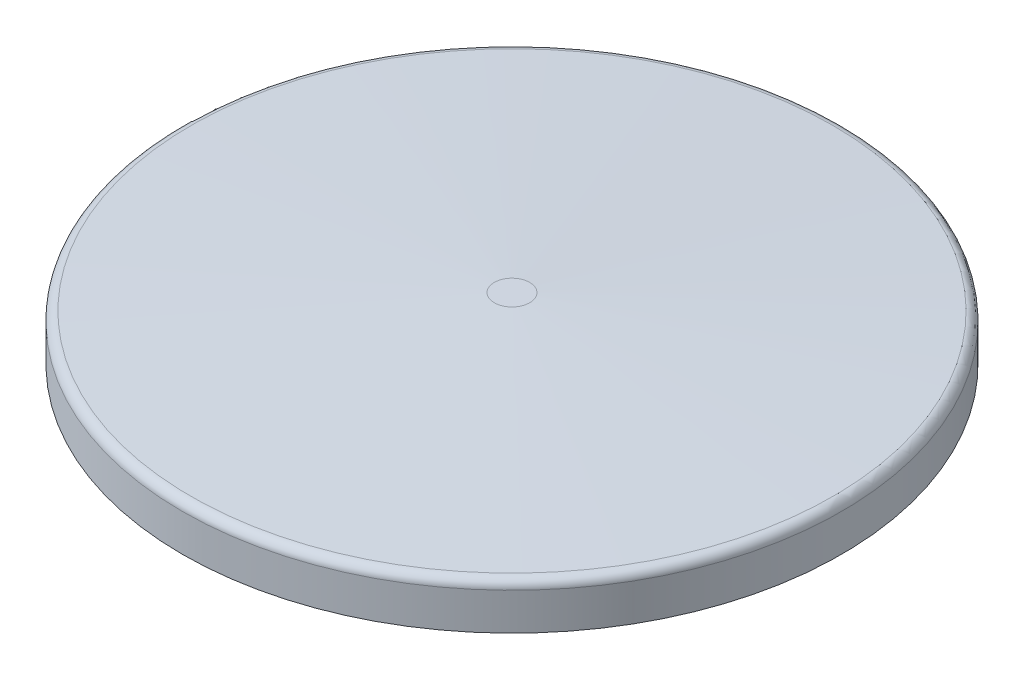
ISO-10303-21;
HEADER;
FILE_DESCRIPTION(('STEP AP214'),'2;1');
FILE_NAME('part.step','',(''),(''),'','','');
FILE_SCHEMA(('AUTOMOTIVE_DESIGN { 1 0 10303 214 1 1 1 1 }'));
ENDSEC;
DATA;
#1=APPLICATION_CONTEXT('core data for automotive mechanical design processes');
#2=APPLICATION_PROTOCOL_DEFINITION('international standard','automotive_design',2000,#1);
#3=PRODUCT_CONTEXT('',#1,'mechanical');
#4=PRODUCT('Part','Part','',(#3));
#5=PRODUCT_RELATED_PRODUCT_CATEGORY('part','',(#4));
#6=PRODUCT_DEFINITION_FORMATION('','',#4);
#7=PRODUCT_DEFINITION_CONTEXT('part definition',#1,'design');
#8=PRODUCT_DEFINITION('design','',#6,#7);
#9=PRODUCT_DEFINITION_SHAPE('','',#8);
#10=(LENGTH_UNIT() NAMED_UNIT(*) SI_UNIT(.MILLI.,.METRE.));
#11=(NAMED_UNIT(*) PLANE_ANGLE_UNIT() SI_UNIT($,.RADIAN.));
#12=(NAMED_UNIT(*) SI_UNIT($,.STERADIAN.) SOLID_ANGLE_UNIT());
#13=UNCERTAINTY_MEASURE_WITH_UNIT(LENGTH_MEASURE(1.E-05),#10,'distance_accuracy_value','');
#14=(GEOMETRIC_REPRESENTATION_CONTEXT(3) GLOBAL_UNCERTAINTY_ASSIGNED_CONTEXT((#13)) GLOBAL_UNIT_ASSIGNED_CONTEXT((#10,
#11,#12)) REPRESENTATION_CONTEXT('',''));
#15=CARTESIAN_POINT('',(0.,0.,0.));
#16=DIRECTION('',(0.,0.,1.));
#17=DIRECTION('',(1.,0.,0.));
#18=AXIS2_PLACEMENT_3D('',#15,#16,#17);
#19=CARTESIAN_POINT('',(-117.475,0.,0.));
#20=DIRECTION('',(0.,1.,0.));
#21=DIRECTION('',(0.,0.,1.));
#22=AXIS2_PLACEMENT_3D('',#19,#20,#21);
#23=PLANE('',#22);
#24=CARTESIAN_POINT('',(39.0337101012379,0.,-94.2357123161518));
#25=DIRECTION('',(0.,-1.,0.));
#26=DIRECTION('',(0.,0.,-1.));
#27=AXIS2_PLACEMENT_3D('',#24,#25,#26);
#28=CIRCLE('',#27,2.579751);
#29=CARTESIAN_POINT('',(39.0337101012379,0.,-96.8154633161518));
#30=VERTEX_POINT('',#29);
#31=EDGE_CURVE('E176',#30,#30,#28,.T.);
#32=ORIENTED_EDGE('',*,*,#31,.F.);
#33=EDGE_LOOP('',(#32));
#34=FACE_BOUND('',#33,.T.);
#35=CARTESIAN_POINT('',(72.124891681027,0.,-72.1248916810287));
#36=DIRECTION('',(0.,-1.,0.));
#37=DIRECTION('',(0.,0.,-1.));
#38=AXIS2_PLACEMENT_3D('',#35,#36,#37);
#39=CIRCLE('',#38,2.57975100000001);
#40=CARTESIAN_POINT('',(72.124891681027,0.,-74.7046426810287));
#41=VERTEX_POINT('',#40);
#42=EDGE_CURVE('E170',#41,#41,#39,.T.);
#43=ORIENTED_EDGE('',*,*,#42,.F.);
#44=EDGE_LOOP('',(#43));
#45=FACE_BOUND('',#44,.T.);
#46=CARTESIAN_POINT('',(94.2357123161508,0.,-39.0337101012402));
#47=DIRECTION('',(0.,-1.,0.));
#48=DIRECTION('',(0.,0.,-1.));
#49=AXIS2_PLACEMENT_3D('',#46,#47,#48);
#50=CIRCLE('',#49,2.57975099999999);
#51=CARTESIAN_POINT('',(94.2357123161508,0.,-41.6134611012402));
#52=VERTEX_POINT('',#51);
#53=EDGE_CURVE('E164',#52,#52,#50,.T.);
#54=ORIENTED_EDGE('',*,*,#53,.F.);
#55=EDGE_LOOP('',(#54));
#56=FACE_BOUND('',#55,.T.);
#57=CARTESIAN_POINT('',(102.,0.,-1.068393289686E-12));
#58=DIRECTION('',(0.,-1.,0.));
#59=DIRECTION('',(0.,0.,-1.));
#60=AXIS2_PLACEMENT_3D('',#57,#58,#59);
#61=CIRCLE('',#60,2.57975100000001);
#62=CARTESIAN_POINT('',(102.,0.,-2.57975100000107));
#63=VERTEX_POINT('',#62);
#64=EDGE_CURVE('E158',#63,#63,#61,.T.);
#65=ORIENTED_EDGE('',*,*,#64,.F.);
#66=EDGE_LOOP('',(#65));
#67=FACE_BOUND('',#66,.T.);
#68=CARTESIAN_POINT('',(94.2357123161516,0.,39.0337101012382));
#69=DIRECTION('',(0.,-1.,0.));
#70=DIRECTION('',(0.,0.,-1.));
#71=AXIS2_PLACEMENT_3D('',#68,#69,#70);
#72=CIRCLE('',#71,2.57975099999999);
#73=CARTESIAN_POINT('',(94.2357123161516,0.,36.4539591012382));
#74=VERTEX_POINT('',#73);
#75=EDGE_CURVE('E152',#74,#74,#72,.T.);
#76=ORIENTED_EDGE('',*,*,#75,.F.);
#77=EDGE_LOOP('',(#76));
#78=FACE_BOUND('',#77,.T.);
#79=CARTESIAN_POINT('',(72.1248916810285,0.,72.1248916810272));
#80=DIRECTION('',(0.,-1.,0.));
#81=DIRECTION('',(0.,0.,-1.));
#82=AXIS2_PLACEMENT_3D('',#79,#80,#81);
#83=CIRCLE('',#82,2.57975100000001);
#84=CARTESIAN_POINT('',(72.1248916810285,0.,69.5451406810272));
#85=VERTEX_POINT('',#84);
#86=EDGE_CURVE('E146',#85,#85,#83,.T.);
#87=ORIENTED_EDGE('',*,*,#86,.F.);
#88=EDGE_LOOP('',(#87));
#89=FACE_BOUND('',#88,.T.);
#90=CARTESIAN_POINT('',(39.0337101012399,0.,94.2357123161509));
#91=DIRECTION('',(0.,-1.,0.));
#92=DIRECTION('',(0.,0.,-1.));
#93=AXIS2_PLACEMENT_3D('',#90,#91,#92);
#94=CIRCLE('',#93,2.579751);
#95=CARTESIAN_POINT('',(39.0337101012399,0.,91.655961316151));
#96=VERTEX_POINT('',#95);
#97=EDGE_CURVE('E140',#96,#96,#94,.T.);
#98=ORIENTED_EDGE('',*,*,#97,.F.);
#99=EDGE_LOOP('',(#98));
#100=FACE_BOUND('',#99,.T.);
#101=CARTESIAN_POINT('',(0.,0.,102.));
#102=DIRECTION('',(0.,-1.,0.));
#103=DIRECTION('',(0.,0.,-1.));
#104=AXIS2_PLACEMENT_3D('',#101,#102,#103);
#105=CIRCLE('',#104,2.579751);
#106=CARTESIAN_POINT('',(0.,0.,99.420249));
#107=VERTEX_POINT('',#106);
#108=EDGE_CURVE('E134',#107,#107,#105,.T.);
#109=ORIENTED_EDGE('',*,*,#108,.F.);
#110=EDGE_LOOP('',(#109));
#111=FACE_BOUND('',#110,.T.);
#112=CARTESIAN_POINT('',(-72.1248916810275,0.,72.1248916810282));
#113=DIRECTION('',(0.,-1.,0.));
#114=DIRECTION('',(0.,0.,-1.));
#115=AXIS2_PLACEMENT_3D('',#112,#113,#114);
#116=CIRCLE('',#115,2.57975100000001);
#117=CARTESIAN_POINT('',(-72.1248916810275,0.,69.5451406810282));
#118=VERTEX_POINT('',#117);
#119=EDGE_CURVE('E122',#118,#118,#116,.T.);
#120=ORIENTED_EDGE('',*,*,#119,.F.);
#121=EDGE_LOOP('',(#120));
#122=FACE_BOUND('',#121,.T.);
#123=CARTESIAN_POINT('',(-94.2357123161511,0.,39.0337101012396));
#124=DIRECTION('',(0.,-1.,0.));
#125=DIRECTION('',(0.,0.,-1.));
#126=AXIS2_PLACEMENT_3D('',#123,#124,#125);
#127=CIRCLE('',#126,2.57975100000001);
#128=CARTESIAN_POINT('',(-94.2357123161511,0.,36.4539591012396));
#129=VERTEX_POINT('',#128);
#130=EDGE_CURVE('E116',#129,#129,#127,.T.);
#131=ORIENTED_EDGE('',*,*,#130,.F.);
#132=EDGE_LOOP('',(#131));
#133=FACE_BOUND('',#132,.T.);
#134=CARTESIAN_POINT('',(-102.,0.,3.56131096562E-13));
#135=DIRECTION('',(0.,-1.,0.));
#136=DIRECTION('',(0.,0.,-1.));
#137=AXIS2_PLACEMENT_3D('',#134,#135,#136);
#138=CIRCLE('',#137,2.57975100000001);
#139=CARTESIAN_POINT('',(-102.,0.,-2.57975099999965));
#140=VERTEX_POINT('',#139);
#141=EDGE_CURVE('E110',#140,#140,#138,.T.);
#142=ORIENTED_EDGE('',*,*,#141,.F.);
#143=EDGE_LOOP('',(#142));
#144=FACE_BOUND('',#143,.T.);
#145=CARTESIAN_POINT('',(-94.2357123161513,0.,-39.0337101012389));
#146=DIRECTION('',(0.,-1.,0.));
#147=DIRECTION('',(0.,0.,-1.));
#148=AXIS2_PLACEMENT_3D('',#145,#146,#147);
#149=CIRCLE('',#148,2.57975100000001);
#150=CARTESIAN_POINT('',(-94.2357123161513,0.,-41.6134611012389));
#151=VERTEX_POINT('',#150);
#152=EDGE_CURVE('E104',#151,#151,#149,.T.);
#153=ORIENTED_EDGE('',*,*,#152,.F.);
#154=EDGE_LOOP('',(#153));
#155=FACE_BOUND('',#154,.T.);
#156=CARTESIAN_POINT('',(-72.124891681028,0.,-72.1248916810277));
#157=DIRECTION('',(0.,-1.,0.));
#158=DIRECTION('',(0.,0.,-1.));
#159=AXIS2_PLACEMENT_3D('',#156,#157,#158);
#160=CIRCLE('',#159,2.57975100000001);
#161=CARTESIAN_POINT('',(-72.124891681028,0.,-74.7046426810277));
#162=VERTEX_POINT('',#161);
#163=EDGE_CURVE('E98',#162,#162,#160,.T.);
#164=ORIENTED_EDGE('',*,*,#163,.F.);
#165=EDGE_LOOP('',(#164));
#166=FACE_BOUND('',#165,.T.);
#167=CARTESIAN_POINT('',(-39.0337101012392,0.,-94.2357123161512));
#168=DIRECTION('',(0.,-1.,0.));
#169=DIRECTION('',(0.,0.,-1.));
#170=AXIS2_PLACEMENT_3D('',#167,#168,#169);
#171=CIRCLE('',#170,2.579751);
#172=CARTESIAN_POINT('',(-39.0337101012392,0.,-96.8154633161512));
#173=VERTEX_POINT('',#172);
#174=EDGE_CURVE('E92',#173,#173,#171,.T.);
#175=ORIENTED_EDGE('',*,*,#174,.F.);
#176=EDGE_LOOP('',(#175));
#177=FACE_BOUND('',#176,.T.);
#178=CARTESIAN_POINT('',(0.,0.,-102.));
#179=DIRECTION('',(0.,-1.,0.));
#180=DIRECTION('',(0.,0.,-1.));
#181=AXIS2_PLACEMENT_3D('',#178,#179,#180);
#182=CIRCLE('',#181,2.579751);
#183=CARTESIAN_POINT('',(0.,0.,-104.579751));
#184=VERTEX_POINT('',#183);
#185=EDGE_CURVE('E86',#184,#184,#182,.T.);
#186=ORIENTED_EDGE('',*,*,#185,.F.);
#187=EDGE_LOOP('',(#186));
#188=FACE_BOUND('',#187,.T.);
#189=CARTESIAN_POINT('',(0.,0.,0.));
#190=DIRECTION('',(0.,-1.,0.));
#191=DIRECTION('',(0.,0.,-1.));
#192=AXIS2_PLACEMENT_3D('',#189,#190,#191);
#193=CIRCLE('',#192,95.);
#194=CARTESIAN_POINT('',(0.,0.,-95.));
#195=VERTEX_POINT('',#194);
#196=EDGE_CURVE('E53',#195,#195,#193,.T.);
#197=ORIENTED_EDGE('',*,*,#196,.F.);
#198=EDGE_LOOP('',(#197));
#199=FACE_BOUND('',#198,.T.);
#200=CARTESIAN_POINT('',(0.,0.,0.));
#201=DIRECTION('',(0.,-1.,0.));
#202=DIRECTION('',(0.,0.,-1.));
#203=AXIS2_PLACEMENT_3D('',#200,#201,#202);
#204=CIRCLE('',#203,107.6198);
#205=CARTESIAN_POINT('',(0.,0.,-107.6198));
#206=VERTEX_POINT('',#205);
#207=EDGE_CURVE('E62',#206,#206,#204,.T.);
#208=ORIENTED_EDGE('',*,*,#207,.T.);
#209=EDGE_LOOP('',(#208));
#210=FACE_BOUND('',#209,.T.);
#211=CARTESIAN_POINT('',(-39.0337101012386,0.,94.2357123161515));
#212=DIRECTION('',(0.,-1.,0.));
#213=DIRECTION('',(0.,0.,-1.));
#214=AXIS2_PLACEMENT_3D('',#211,#212,#213);
#215=CIRCLE('',#214,2.579751);
#216=CARTESIAN_POINT('',(-39.0337101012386,0.,91.6559613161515));
#217=VERTEX_POINT('',#216);
#218=EDGE_CURVE('E128',#217,#217,#215,.T.);
#219=ORIENTED_EDGE('',*,*,#218,.F.);
#220=EDGE_LOOP('',(#219));
#221=FACE_BOUND('',#220,.T.);
#222=ADVANCED_FACE('F30',(#34,#45,#56,#67,#78,#89,#100,#111,#122,#133,#144,#155,#166,#177,#188,
#199,#210,#221),#23,.F.);
#223=CARTESIAN_POINT('',(0.,0.,0.));
#224=DIRECTION('',(0.,-1.,0.));
#225=DIRECTION('',(0.,0.,-1.));
#226=AXIS2_PLACEMENT_3D('',#223,#224,#225);
#227=CYLINDRICAL_SURFACE('',#226,117.475);
#228=CARTESIAN_POINT('',(0.,0.,0.));
#229=DIRECTION('',(0.,-1.,0.));
#230=DIRECTION('',(0.,0.,-1.));
#231=AXIS2_PLACEMENT_3D('',#228,#229,#230);
#232=CIRCLE('',#231,117.475);
#233=CARTESIAN_POINT('',(0.,0.,-117.475));
#234=VERTEX_POINT('',#233);
#235=EDGE_CURVE('E56',#234,#234,#232,.T.);
#236=ORIENTED_EDGE('',*,*,#235,.F.);
#237=EDGE_LOOP('',(#236));
#238=FACE_BOUND('',#237,.T.);
#239=CARTESIAN_POINT('',(0.,13.2430375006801,0.));
#240=DIRECTION('',(0.,-1.,0.));
#241=DIRECTION('',(0.,0.,-1.));
#242=AXIS2_PLACEMENT_3D('',#239,#240,#241);
#243=CIRCLE('',#242,117.475);
#244=CARTESIAN_POINT('',(0.,13.2430375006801,-117.475));
#245=VERTEX_POINT('',#244);
#246=EDGE_CURVE('E10',#245,#245,#243,.T.);
#247=ORIENTED_EDGE('',*,*,#246,.T.);
#248=EDGE_LOOP('',(#247));
#249=FACE_BOUND('',#248,.T.);
#250=ADVANCED_FACE('F32',(#238,#249),#227,.T.);
#251=CARTESIAN_POINT('',(0.,13.2430375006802,0.));
#252=DIRECTION('',(0.,-1.,0.));
#253=DIRECTION('',(0.,0.,-1.));
#254=AXIS2_PLACEMENT_3D('',#251,#252,#253);
#255=TOROIDAL_SURFACE('',#254,114.3,3.175);
#256=ORIENTED_EDGE('',*,*,#246,.F.);
#257=EDGE_LOOP('',(#256));
#258=FACE_BOUND('',#257,.T.);
#259=CARTESIAN_POINT('',(0.,16.4136862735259,0.));
#260=DIRECTION('',(0.,-1.,0.));
#261=DIRECTION('',(0.,0.,-1.));
#262=AXIS2_PLACEMENT_3D('',#259,#260,#261);
#263=CIRCLE('',#262,114.466166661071);
#264=CARTESIAN_POINT('',(0.,16.4136862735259,-114.466166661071));
#265=VERTEX_POINT('',#264);
#266=EDGE_CURVE('E37',#265,#265,#263,.T.);
#267=ORIENTED_EDGE('',*,*,#266,.T.);
#268=EDGE_LOOP('',(#267));
#269=FACE_BOUND('',#268,.T.);
#270=ADVANCED_FACE('F342',(#258,#269),#255,.T.);
#271=CARTESIAN_POINT('',(0.,22.0826574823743,0.));
#272=DIRECTION('',(0.,-1.,0.));
#273=DIRECTION('',(0.,0.,-1.));
#274=AXIS2_PLACEMENT_3D('',#271,#272,#273);
#275=CONICAL_SURFACE('',#274,6.29575214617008,1.5184364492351);
#276=CARTESIAN_POINT('',(0.,22.0826574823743,0.));
#277=DIRECTION('',(0.,-1.,0.));
#278=DIRECTION('',(0.,0.,-1.));
#279=AXIS2_PLACEMENT_3D('',#276,#277,#278);
#280=CIRCLE('',#279,6.29575214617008);
#281=CARTESIAN_POINT('',(0.,22.0826574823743,-6.29575214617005));
#282=VERTEX_POINT('',#281);
#283=EDGE_CURVE('E41',#282,#282,#280,.T.);
#284=CARTESIAN_POINT('',(0.,16.4136862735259,-114.466166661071));
#285=CARTESIAN_POINT('',(0.,16.4727380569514,-113.339391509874));
#286=CARTESIAN_POINT('',(0.,16.5317898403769,-112.212616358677));
#287=CARTESIAN_POINT('',(0.,16.649893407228,-109.959066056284));
#288=CARTESIAN_POINT('',(0.,16.7089451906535,-108.832290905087));
#289=CARTESIAN_POINT('',(0.,16.8270487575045,-106.578740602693));
#290=CARTESIAN_POINT('',(0.,16.88610054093,-105.451965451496));
#291=CARTESIAN_POINT('',(0.,17.004204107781,-103.198415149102));
#292=CARTESIAN_POINT('',(0.,17.0632558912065,-102.071639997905));
#293=CARTESIAN_POINT('',(0.,17.1813594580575,-99.8180896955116));
#294=CARTESIAN_POINT('',(0.,17.240411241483,-98.6913145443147));
#295=CARTESIAN_POINT('',(0.,17.358514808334,-96.4377642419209));
#296=CARTESIAN_POINT('',(0.,17.4175665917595,-95.310989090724));
#297=CARTESIAN_POINT('',(0.,17.5356701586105,-93.0574387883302));
#298=CARTESIAN_POINT('',(0.,17.594721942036,-91.9306636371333));
#299=CARTESIAN_POINT('',(0.,17.712825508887,-89.6771133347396));
#300=CARTESIAN_POINT('',(0.,17.7718772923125,-88.5503381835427));
#301=CARTESIAN_POINT('',(0.,17.8899808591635,-86.2967878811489));
#302=CARTESIAN_POINT('',(0.,17.949032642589,-85.170012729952));
#303=CARTESIAN_POINT('',(0.,18.06713620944,-82.9164624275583));
#304=CARTESIAN_POINT('',(0.,18.1261879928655,-81.7896872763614));
#305=CARTESIAN_POINT('',(0.,18.2442915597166,-79.5361369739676));
#306=CARTESIAN_POINT('',(0.,18.3033433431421,-78.4093618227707));
#307=CARTESIAN_POINT('',(0.,18.4214469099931,-76.155811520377));
#308=CARTESIAN_POINT('',(0.,18.4804986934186,-75.0290363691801));
#309=CARTESIAN_POINT('',(0.,18.5986022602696,-72.7754860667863));
#310=CARTESIAN_POINT('',(0.,18.6576540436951,-71.6487109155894));
#311=CARTESIAN_POINT('',(0.,18.7757576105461,-69.3951606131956));
#312=CARTESIAN_POINT('',(0.,18.8348093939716,-68.2683854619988));
#313=CARTESIAN_POINT('',(0.,18.9529129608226,-66.014835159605));
#314=CARTESIAN_POINT('',(0.,19.0119647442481,-64.8880600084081));
#315=CARTESIAN_POINT('',(0.,19.1300683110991,-62.6345097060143));
#316=CARTESIAN_POINT('',(0.,19.1891200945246,-61.5077345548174));
#317=CARTESIAN_POINT('',(0.,19.3072236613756,-59.2541842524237));
#318=CARTESIAN_POINT('',(0.,19.3662754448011,-58.1274091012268));
#319=CARTESIAN_POINT('',(0.,19.4843790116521,-55.873858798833));
#320=CARTESIAN_POINT('',(0.,19.5434307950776,-54.7470836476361));
#321=CARTESIAN_POINT('',(0.,19.6615343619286,-52.4935333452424));
#322=CARTESIAN_POINT('',(0.,19.7205861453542,-51.3667581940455));
#323=CARTESIAN_POINT('',(0.,19.8386897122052,-49.1132078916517));
#324=CARTESIAN_POINT('',(0.,19.8977414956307,-47.9864327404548));
#325=CARTESIAN_POINT('',(0.,20.0158450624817,-45.732882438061));
#326=CARTESIAN_POINT('',(0.,20.0748968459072,-44.6061072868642));
#327=CARTESIAN_POINT('',(0.,20.1930004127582,-42.3525569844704));
#328=CARTESIAN_POINT('',(0.,20.2520521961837,-41.2257818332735));
#329=CARTESIAN_POINT('',(0.,20.3701557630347,-38.9722315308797));
#330=CARTESIAN_POINT('',(0.,20.4292075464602,-37.8454563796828));
#331=CARTESIAN_POINT('',(0.,20.5473111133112,-35.5919060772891));
#332=CARTESIAN_POINT('',(0.,20.6063628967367,-34.4651309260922));
#333=CARTESIAN_POINT('',(0.,20.7244664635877,-32.2115806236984));
#334=CARTESIAN_POINT('',(0.,20.7835182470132,-31.0848054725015));
#335=CARTESIAN_POINT('',(0.,20.9016218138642,-28.8312551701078));
#336=CARTESIAN_POINT('',(0.,20.9606735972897,-27.7044800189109));
#337=CARTESIAN_POINT('',(0.,21.0787771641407,-25.4509297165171));
#338=CARTESIAN_POINT('',(0.,21.1378289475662,-24.3241545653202));
#339=CARTESIAN_POINT('',(0.,21.2559325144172,-22.0706042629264));
#340=CARTESIAN_POINT('',(0.,21.3149842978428,-20.9438291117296));
#341=CARTESIAN_POINT('',(0.,21.4330878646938,-18.6902788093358));
#342=CARTESIAN_POINT('',(0.,21.4921396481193,-17.5635036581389));
#343=CARTESIAN_POINT('',(0.,21.6102432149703,-15.3099533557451));
#344=CARTESIAN_POINT('',(0.,21.6692949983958,-14.1831782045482));
#345=CARTESIAN_POINT('',(0.,21.7873985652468,-11.9296279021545));
#346=CARTESIAN_POINT('',(0.,21.8464503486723,-10.8028527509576));
#347=CARTESIAN_POINT('',(0.,21.9645539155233,-8.54930244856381));
#348=CARTESIAN_POINT('',(0.,22.0236056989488,-7.42252729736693));
#349=CARTESIAN_POINT('',(0.,22.0826574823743,-6.29575214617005));
#350=B_SPLINE_CURVE_WITH_KNOTS('',3,(#284,#285,#286,#287,#288,#289,#290,#291,#292,#293,#294,
#295,#296,#297,#298,#299,#300,#301,#302,#303,#304,#305,#306,#307,#308,#309,#310,#311,#312,#313,
#314,#315,#316,#317,#318,#319,#320,#321,#322,#323,#324,#325,#326,#327,#328,#329,#330,#331,#332,
#333,#334,#335,#336,#337,#338,#339,#340,#341,#342,#343,#344,#345,#346,#347,#348,#349),
.UNSPECIFIED.,.F.,.F.,(4,2,2,2,2,2,2,2,2,2,2,2,2,2,2,2,2,2,2,2,2,2,2,2,2,2,2,2,2,2,2,2,4),(0.,
3.38496442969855,6.76992885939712,10.1548932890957,13.5398577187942,16.9248221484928,
20.3097865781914,23.6947510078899,27.0797154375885,30.464679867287,33.8496442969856,
37.2346087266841,40.6195731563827,44.0045375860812,47.3895020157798,50.7744664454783,
54.1594308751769,57.5443953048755,60.929359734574,64.3143241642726,67.6992885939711,
71.0842530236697,74.4692174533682,77.8541818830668,81.2391463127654,84.6241107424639,
88.0090751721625,91.394039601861,94.7790040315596,98.1639684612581,101.548932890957,
104.933897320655,108.318861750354),.UNSPECIFIED.);
#351=EDGE_CURVE('BSEAM339',#265,#282,#350,.T.);
#352=ORIENTED_EDGE('',*,*,#266,.F.);
#353=ORIENTED_EDGE('',*,*,#283,.T.);
#354=ORIENTED_EDGE('',*,*,#351,.T.);
#355=ORIENTED_EDGE('',*,*,#351,.F.);
#356=EDGE_LOOP('',(#352,#354,#353,#355));
#357=FACE_BOUND('',#356,.T.);
#358=ADVANCED_FACE('F339',(#357),#275,.T.);
#359=CARTESIAN_POINT('',(-6.29575214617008,22.0826574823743,0.));
#360=DIRECTION('',(0.,-1.,0.));
#361=DIRECTION('',(0.,0.,-1.));
#362=AXIS2_PLACEMENT_3D('',#359,#360,#361);
#363=PLANE('',#362);
#364=ORIENTED_EDGE('',*,*,#283,.F.);
#365=EDGE_LOOP('',(#364));
#366=FACE_BOUND('',#365,.T.);
#367=ADVANCED_FACE('F325',(#366),#363,.F.);
#368=CARTESIAN_POINT('',(0.,0.,0.));
#369=DIRECTION('',(0.,-1.,0.));
#370=DIRECTION('',(0.,0.,-1.));
#371=AXIS2_PLACEMENT_3D('',#368,#369,#370);
#372=CIRCLE('',#371,112.4966);
#373=CARTESIAN_POINT('',(0.,0.,-112.4966));
#374=VERTEX_POINT('',#373);
#375=EDGE_CURVE('E59',#374,#374,#372,.T.);
#376=ORIENTED_EDGE('',*,*,#375,.F.);
#377=EDGE_LOOP('',(#376));
#378=FACE_BOUND('',#377,.T.);
#379=ORIENTED_EDGE('',*,*,#235,.T.);
#380=EDGE_LOOP('',(#379));
#381=FACE_BOUND('',#380,.T.);
#382=ADVANCED_FACE('F185',(#378,#381),#23,.F.);
#383=CARTESIAN_POINT('',(0.,0.127,0.));
#384=DIRECTION('',(0.,-1.,0.));
#385=DIRECTION('',(0.,0.,-1.));
#386=AXIS2_PLACEMENT_3D('',#383,#384,#385);
#387=TOROIDAL_SURFACE('',#386,112.4966,0.126999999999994);
#388=ORIENTED_EDGE('',*,*,#375,.T.);
#389=EDGE_LOOP('',(#388));
#390=FACE_BOUND('',#389,.T.);
#391=CARTESIAN_POINT('',(0.,0.127,0.));
#392=DIRECTION('',(0.,-1.,0.));
#393=DIRECTION('',(0.,0.,-1.));
#394=AXIS2_PLACEMENT_3D('',#391,#392,#393);
#395=CIRCLE('',#394,112.3696);
#396=CARTESIAN_POINT('',(0.,0.127,-112.3696));
#397=VERTEX_POINT('',#396);
#398=EDGE_CURVE('E80',#397,#397,#395,.T.);
#399=ORIENTED_EDGE('',*,*,#398,.F.);
#400=EDGE_LOOP('',(#399));
#401=FACE_BOUND('',#400,.T.);
#402=ADVANCED_FACE('F319',(#390,#401),#387,.T.);
#403=CARTESIAN_POINT('',(0.,0.127000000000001,0.));
#404=DIRECTION('',(0.,-1.,0.));
#405=DIRECTION('',(0.,0.,-1.));
#406=AXIS2_PLACEMENT_3D('',#403,#404,#405);
#407=TOROIDAL_SURFACE('',#406,107.6198,0.126999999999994);
#408=CARTESIAN_POINT('',(0.,0.127000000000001,0.));
#409=DIRECTION('',(0.,-1.,0.));
#410=DIRECTION('',(0.,0.,-1.));
#411=AXIS2_PLACEMENT_3D('',#408,#409,#410);
#412=CIRCLE('',#411,107.7468);
#413=CARTESIAN_POINT('',(0.,0.127000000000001,-107.7468));
#414=VERTEX_POINT('',#413);
#415=EDGE_CURVE('E65',#414,#414,#412,.T.);
#416=ORIENTED_EDGE('',*,*,#415,.T.);
#417=EDGE_LOOP('',(#416));
#418=FACE_BOUND('',#417,.T.);
#419=ORIENTED_EDGE('',*,*,#207,.F.);
#420=EDGE_LOOP('',(#419));
#421=FACE_BOUND('',#420,.T.);
#422=ADVANCED_FACE('F315',(#418,#421),#407,.T.);
#423=CARTESIAN_POINT('',(0.,0.,0.));
#424=DIRECTION('',(0.,-1.,0.));
#425=DIRECTION('',(0.,0.,-1.));
#426=AXIS2_PLACEMENT_3D('',#423,#424,#425);
#427=CYLINDRICAL_SURFACE('',#426,107.7468);
#428=CARTESIAN_POINT('',(0.,2.1971,0.));
#429=DIRECTION('',(0.,-1.,0.));
#430=DIRECTION('',(0.,0.,-1.));
#431=AXIS2_PLACEMENT_3D('',#428,#429,#430);
#432=CIRCLE('',#431,107.7468);
#433=CARTESIAN_POINT('',(0.,2.1971,-107.7468));
#434=VERTEX_POINT('',#433);
#435=EDGE_CURVE('E68',#434,#434,#432,.T.);
#436=ORIENTED_EDGE('',*,*,#435,.T.);
#437=EDGE_LOOP('',(#436));
#438=FACE_BOUND('',#437,.T.);
#439=ORIENTED_EDGE('',*,*,#415,.F.);
#440=EDGE_LOOP('',(#439));
#441=FACE_BOUND('',#440,.T.);
#442=ADVANCED_FACE('F311',(#438,#441),#427,.T.);
#443=CARTESIAN_POINT('',(0.,2.1971,0.));
#444=DIRECTION('',(0.,-1.,0.));
#445=DIRECTION('',(0.,0.,-1.));
#446=AXIS2_PLACEMENT_3D('',#443,#444,#445);
#447=TOROIDAL_SURFACE('',#446,108.1913,0.4445);
#448=CARTESIAN_POINT('',(0.,2.6416,0.));
#449=DIRECTION('',(0.,-1.,0.));
#450=DIRECTION('',(0.,0.,-1.));
#451=AXIS2_PLACEMENT_3D('',#448,#449,#450);
#452=CIRCLE('',#451,108.1913);
#453=CARTESIAN_POINT('',(0.,2.6416,-108.1913));
#454=VERTEX_POINT('',#453);
#455=EDGE_CURVE('E71',#454,#454,#452,.T.);
#456=ORIENTED_EDGE('',*,*,#455,.T.);
#457=EDGE_LOOP('',(#456));
#458=FACE_BOUND('',#457,.T.);
#459=ORIENTED_EDGE('',*,*,#435,.F.);
#460=EDGE_LOOP('',(#459));
#461=FACE_BOUND('',#460,.T.);
#462=ADVANCED_FACE('F307',(#458,#461),#447,.F.);
#463=CARTESIAN_POINT('',(-111.9251,2.6416,0.));
#464=DIRECTION('',(0.,-1.,0.));
#465=DIRECTION('',(0.,0.,-1.));
#466=AXIS2_PLACEMENT_3D('',#463,#464,#465);
#467=PLANE('',#466);
#468=CARTESIAN_POINT('',(0.,2.6416,0.));
#469=DIRECTION('',(0.,-1.,0.));
#470=DIRECTION('',(0.,0.,-1.));
#471=AXIS2_PLACEMENT_3D('',#468,#469,#470);
#472=CIRCLE('',#471,111.9251);
#473=CARTESIAN_POINT('',(0.,2.6416,-111.9251));
#474=VERTEX_POINT('',#473);
#475=EDGE_CURVE('E74',#474,#474,#472,.T.);
#476=ORIENTED_EDGE('',*,*,#475,.T.);
#477=EDGE_LOOP('',(#476));
#478=FACE_BOUND('',#477,.T.);
#479=ORIENTED_EDGE('',*,*,#455,.F.);
#480=EDGE_LOOP('',(#479));
#481=FACE_BOUND('',#480,.T.);
#482=ADVANCED_FACE('F303',(#478,#481),#467,.T.);
#483=CARTESIAN_POINT('',(0.,2.1971,0.));
#484=DIRECTION('',(0.,-1.,0.));
#485=DIRECTION('',(0.,0.,-1.));
#486=AXIS2_PLACEMENT_3D('',#483,#484,#485);
#487=TOROIDAL_SURFACE('',#486,111.9251,0.4445);
#488=CARTESIAN_POINT('',(0.,2.1971,0.));
#489=DIRECTION('',(0.,-1.,0.));
#490=DIRECTION('',(0.,0.,-1.));
#491=AXIS2_PLACEMENT_3D('',#488,#489,#490);
#492=CIRCLE('',#491,112.3696);
#493=CARTESIAN_POINT('',(0.,2.1971,-112.3696));
#494=VERTEX_POINT('',#493);
#495=EDGE_CURVE('E77',#494,#494,#492,.T.);
#496=ORIENTED_EDGE('',*,*,#495,.T.);
#497=EDGE_LOOP('',(#496));
#498=FACE_BOUND('',#497,.T.);
#499=ORIENTED_EDGE('',*,*,#475,.F.);
#500=EDGE_LOOP('',(#499));
#501=FACE_BOUND('',#500,.T.);
#502=ADVANCED_FACE('F299',(#498,#501),#487,.F.);
#503=CARTESIAN_POINT('',(0.,0.,0.));
#504=DIRECTION('',(0.,-1.,0.));
#505=DIRECTION('',(0.,0.,-1.));
#506=AXIS2_PLACEMENT_3D('',#503,#504,#505);
#507=CYLINDRICAL_SURFACE('',#506,112.3696);
#508=ORIENTED_EDGE('',*,*,#398,.T.);
#509=EDGE_LOOP('',(#508));
#510=FACE_BOUND('',#509,.T.);
#511=ORIENTED_EDGE('',*,*,#495,.F.);
#512=EDGE_LOOP('',(#511));
#513=FACE_BOUND('',#512,.T.);
#514=ADVANCED_FACE('F295',(#510,#513),#507,.F.);
#515=CARTESIAN_POINT('',(0.,12.3468933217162,0.));
#516=DIRECTION('',(0.,1.,0.));
#517=DIRECTION('',(0.,0.,1.));
#518=AXIS2_PLACEMENT_3D('',#515,#516,#517);
#519=PLANE('',#518);
#520=CARTESIAN_POINT('',(0.,12.3468933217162,0.));
#521=DIRECTION('',(0.,-1.,0.));
#522=DIRECTION('',(0.,0.,-1.));
#523=AXIS2_PLACEMENT_3D('',#520,#521,#522);
#524=CIRCLE('',#523,88.65);
#525=CARTESIAN_POINT('',(0.,12.3468933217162,-88.65));
#526=VERTEX_POINT('',#525);
#527=EDGE_CURVE('E45',#526,#526,#524,.T.);
#528=ORIENTED_EDGE('',*,*,#527,.T.);
#529=EDGE_LOOP('',(#528));
#530=FACE_BOUND('',#529,.T.);
#531=ADVANCED_FACE('F298',(#530),#519,.F.);
#532=CARTESIAN_POINT('',(0.,5.99689332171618,0.));
#533=DIRECTION('',(0.,-1.,0.));
#534=DIRECTION('',(0.,0.,-1.));
#535=AXIS2_PLACEMENT_3D('',#532,#533,#534);
#536=TOROIDAL_SURFACE('',#535,88.65,6.35);
#537=ORIENTED_EDGE('',*,*,#527,.F.);
#538=EDGE_LOOP('',(#537));
#539=FACE_BOUND('',#538,.T.);
#540=CARTESIAN_POINT('',(0.,5.99689332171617,0.));
#541=DIRECTION('',(0.,-1.,0.));
#542=DIRECTION('',(0.,0.,-1.));
#543=AXIS2_PLACEMENT_3D('',#540,#541,#542);
#544=CIRCLE('',#543,95.);
#545=CARTESIAN_POINT('',(0.,5.99689332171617,-95.));
#546=VERTEX_POINT('',#545);
#547=EDGE_CURVE('E50',#546,#546,#544,.T.);
#548=ORIENTED_EDGE('',*,*,#547,.T.);
#549=EDGE_LOOP('',(#548));
#550=FACE_BOUND('',#549,.T.);
#551=ADVANCED_FACE('F329',(#539,#550),#536,.F.);
#552=CARTESIAN_POINT('',(0.,0.,0.));
#553=DIRECTION('',(0.,-1.,0.));
#554=DIRECTION('',(0.,0.,-1.));
#555=AXIS2_PLACEMENT_3D('',#552,#553,#554);
#556=CYLINDRICAL_SURFACE('',#555,95.);
#557=ORIENTED_EDGE('',*,*,#547,.F.);
#558=EDGE_LOOP('',(#557));
#559=FACE_BOUND('',#558,.T.);
#560=ORIENTED_EDGE('',*,*,#196,.T.);
#561=EDGE_LOOP('',(#560));
#562=FACE_BOUND('',#561,.T.);
#563=ADVANCED_FACE('F293',(#559,#562),#556,.F.);
#564=CARTESIAN_POINT('',(0.,11.43,-102.));
#565=DIRECTION('',(0.,1.,0.));
#566=DIRECTION('',(0.,0.,1.));
#567=AXIS2_PLACEMENT_3D('',#564,#565,#566);
#568=PLANE('',#567);
#569=CARTESIAN_POINT('',(0.,11.43,-102.));
#570=DIRECTION('',(0.,-1.,0.));
#571=DIRECTION('',(0.,0.,-1.));
#572=AXIS2_PLACEMENT_3D('',#569,#570,#571);
#573=CIRCLE('',#572,2.579751);
#574=CARTESIAN_POINT('',(0.,11.43,-104.579751));
#575=VERTEX_POINT('',#574);
#576=EDGE_CURVE('E83',#575,#575,#573,.T.);
#577=ORIENTED_EDGE('',*,*,#576,.T.);
#578=EDGE_LOOP('',(#577));
#579=FACE_BOUND('',#578,.T.);
#580=ADVANCED_FACE('F289',(#579),#568,.F.);
#581=CARTESIAN_POINT('',(0.,0.,-102.));
#582=DIRECTION('',(0.,-1.,0.));
#583=DIRECTION('',(0.,0.,-1.));
#584=AXIS2_PLACEMENT_3D('',#581,#582,#583);
#585=CYLINDRICAL_SURFACE('',#584,2.579751);
#586=ORIENTED_EDGE('',*,*,#576,.F.);
#587=EDGE_LOOP('',(#586));
#588=FACE_BOUND('',#587,.T.);
#589=ORIENTED_EDGE('',*,*,#185,.T.);
#590=EDGE_LOOP('',(#589));
#591=FACE_BOUND('',#590,.T.);
#592=ADVANCED_FACE('F285',(#588,#591),#585,.F.);
#593=CARTESIAN_POINT('',(-39.0337101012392,11.43,-94.2357123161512));
#594=DIRECTION('',(0.,1.,0.));
#595=DIRECTION('',(0.,0.,1.));
#596=AXIS2_PLACEMENT_3D('',#593,#594,#595);
#597=PLANE('',#596);
#598=CARTESIAN_POINT('',(-39.0337101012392,11.43,-94.2357123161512));
#599=DIRECTION('',(0.,-1.,0.));
#600=DIRECTION('',(0.,0.,-1.));
#601=AXIS2_PLACEMENT_3D('',#598,#599,#600);
#602=CIRCLE('',#601,2.579751);
#603=CARTESIAN_POINT('',(-39.0337101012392,11.43,-96.8154633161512));
#604=VERTEX_POINT('',#603);
#605=EDGE_CURVE('E89',#604,#604,#602,.T.);
#606=ORIENTED_EDGE('',*,*,#605,.T.);
#607=EDGE_LOOP('',(#606));
#608=FACE_BOUND('',#607,.T.);
#609=ADVANCED_FACE('F281',(#608),#597,.F.);
#610=CARTESIAN_POINT('',(-39.0337101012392,0.,-94.2357123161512));
#611=DIRECTION('',(0.,-1.,0.));
#612=DIRECTION('',(0.,0.,-1.));
#613=AXIS2_PLACEMENT_3D('',#610,#611,#612);
#614=CYLINDRICAL_SURFACE('',#613,2.579751);
#615=ORIENTED_EDGE('',*,*,#605,.F.);
#616=EDGE_LOOP('',(#615));
#617=FACE_BOUND('',#616,.T.);
#618=ORIENTED_EDGE('',*,*,#174,.T.);
#619=EDGE_LOOP('',(#618));
#620=FACE_BOUND('',#619,.T.);
#621=ADVANCED_FACE('F277',(#617,#620),#614,.F.);
#622=CARTESIAN_POINT('',(-72.124891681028,11.43,-72.1248916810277));
#623=DIRECTION('',(0.,1.,0.));
#624=DIRECTION('',(0.,0.,1.));
#625=AXIS2_PLACEMENT_3D('',#622,#623,#624);
#626=PLANE('',#625);
#627=CARTESIAN_POINT('',(-72.124891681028,11.43,-72.1248916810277));
#628=DIRECTION('',(0.,-1.,0.));
#629=DIRECTION('',(0.,0.,-1.));
#630=AXIS2_PLACEMENT_3D('',#627,#628,#629);
#631=CIRCLE('',#630,2.57975099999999);
#632=CARTESIAN_POINT('',(-72.124891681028,11.43,-74.7046426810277));
#633=VERTEX_POINT('',#632);
#634=EDGE_CURVE('E95',#633,#633,#631,.T.);
#635=ORIENTED_EDGE('',*,*,#634,.T.);
#636=EDGE_LOOP('',(#635));
#637=FACE_BOUND('',#636,.T.);
#638=ADVANCED_FACE('F273',(#637),#626,.F.);
#639=CARTESIAN_POINT('',(-72.124891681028,0.,-72.1248916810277));
#640=DIRECTION('',(0.,-1.,0.));
#641=DIRECTION('',(0.,0.,-1.));
#642=AXIS2_PLACEMENT_3D('',#639,#640,#641);
#643=CYLINDRICAL_SURFACE('',#642,2.579751);
#644=ORIENTED_EDGE('',*,*,#634,.F.);
#645=EDGE_LOOP('',(#644));
#646=FACE_BOUND('',#645,.T.);
#647=ORIENTED_EDGE('',*,*,#163,.T.);
#648=EDGE_LOOP('',(#647));
#649=FACE_BOUND('',#648,.T.);
#650=ADVANCED_FACE('F269',(#646,#649),#643,.F.);
#651=CARTESIAN_POINT('',(-94.2357123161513,11.43,-39.0337101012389));
#652=DIRECTION('',(0.,1.,0.));
#653=DIRECTION('',(0.,0.,1.));
#654=AXIS2_PLACEMENT_3D('',#651,#652,#653);
#655=PLANE('',#654);
#656=CARTESIAN_POINT('',(-94.2357123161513,11.43,-39.0337101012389));
#657=DIRECTION('',(0.,-1.,0.));
#658=DIRECTION('',(0.,0.,-1.));
#659=AXIS2_PLACEMENT_3D('',#656,#657,#658);
#660=CIRCLE('',#659,2.57975099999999);
#661=CARTESIAN_POINT('',(-94.2357123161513,11.43,-41.6134611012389));
#662=VERTEX_POINT('',#661);
#663=EDGE_CURVE('E101',#662,#662,#660,.T.);
#664=ORIENTED_EDGE('',*,*,#663,.T.);
#665=EDGE_LOOP('',(#664));
#666=FACE_BOUND('',#665,.T.);
#667=ADVANCED_FACE('F265',(#666),#655,.F.);
#668=CARTESIAN_POINT('',(-94.2357123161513,0.,-39.0337101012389));
#669=DIRECTION('',(0.,-1.,0.));
#670=DIRECTION('',(0.,0.,-1.));
#671=AXIS2_PLACEMENT_3D('',#668,#669,#670);
#672=CYLINDRICAL_SURFACE('',#671,2.579751);
#673=ORIENTED_EDGE('',*,*,#663,.F.);
#674=EDGE_LOOP('',(#673));
#675=FACE_BOUND('',#674,.T.);
#676=ORIENTED_EDGE('',*,*,#152,.T.);
#677=EDGE_LOOP('',(#676));
#678=FACE_BOUND('',#677,.T.);
#679=ADVANCED_FACE('F261',(#675,#678),#672,.F.);
#680=CARTESIAN_POINT('',(-102.,11.43,3.56131096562E-13));
#681=DIRECTION('',(0.,1.,0.));
#682=DIRECTION('',(0.,0.,1.));
#683=AXIS2_PLACEMENT_3D('',#680,#681,#682);
#684=PLANE('',#683);
#685=CARTESIAN_POINT('',(-102.,11.43,3.56131096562E-13));
#686=DIRECTION('',(0.,-1.,0.));
#687=DIRECTION('',(0.,0.,-1.));
#688=AXIS2_PLACEMENT_3D('',#685,#686,#687);
#689=CIRCLE('',#688,2.57975099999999);
#690=CARTESIAN_POINT('',(-102.,11.43,-2.57975099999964));
#691=VERTEX_POINT('',#690);
#692=EDGE_CURVE('E107',#691,#691,#689,.T.);
#693=ORIENTED_EDGE('',*,*,#692,.T.);
#694=EDGE_LOOP('',(#693));
#695=FACE_BOUND('',#694,.T.);
#696=ADVANCED_FACE('F257',(#695),#684,.F.);
#697=CARTESIAN_POINT('',(-102.,0.,3.56131096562E-13));
#698=DIRECTION('',(0.,-1.,0.));
#699=DIRECTION('',(0.,0.,-1.));
#700=AXIS2_PLACEMENT_3D('',#697,#698,#699);
#701=CYLINDRICAL_SURFACE('',#700,2.579751);
#702=ORIENTED_EDGE('',*,*,#692,.F.);
#703=EDGE_LOOP('',(#702));
#704=FACE_BOUND('',#703,.T.);
#705=ORIENTED_EDGE('',*,*,#141,.T.);
#706=EDGE_LOOP('',(#705));
#707=FACE_BOUND('',#706,.T.);
#708=ADVANCED_FACE('F253',(#704,#707),#701,.F.);
#709=CARTESIAN_POINT('',(-94.2357123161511,11.43,39.0337101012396));
#710=DIRECTION('',(0.,1.,0.));
#711=DIRECTION('',(0.,0.,1.));
#712=AXIS2_PLACEMENT_3D('',#709,#710,#711);
#713=PLANE('',#712);
#714=CARTESIAN_POINT('',(-94.2357123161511,11.43,39.0337101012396));
#715=DIRECTION('',(0.,-1.,0.));
#716=DIRECTION('',(0.,0.,-1.));
#717=AXIS2_PLACEMENT_3D('',#714,#715,#716);
#718=CIRCLE('',#717,2.57975099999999);
#719=CARTESIAN_POINT('',(-94.2357123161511,11.43,36.4539591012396));
#720=VERTEX_POINT('',#719);
#721=EDGE_CURVE('E113',#720,#720,#718,.T.);
#722=ORIENTED_EDGE('',*,*,#721,.T.);
#723=EDGE_LOOP('',(#722));
#724=FACE_BOUND('',#723,.T.);
#725=ADVANCED_FACE('F249',(#724),#713,.F.);
#726=CARTESIAN_POINT('',(-94.2357123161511,0.,39.0337101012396));
#727=DIRECTION('',(0.,-1.,0.));
#728=DIRECTION('',(0.,0.,-1.));
#729=AXIS2_PLACEMENT_3D('',#726,#727,#728);
#730=CYLINDRICAL_SURFACE('',#729,2.579751);
#731=ORIENTED_EDGE('',*,*,#721,.F.);
#732=EDGE_LOOP('',(#731));
#733=FACE_BOUND('',#732,.T.);
#734=ORIENTED_EDGE('',*,*,#130,.T.);
#735=EDGE_LOOP('',(#734));
#736=FACE_BOUND('',#735,.T.);
#737=ADVANCED_FACE('F245',(#733,#736),#730,.F.);
#738=CARTESIAN_POINT('',(-72.1248916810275,11.43,72.1248916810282));
#739=DIRECTION('',(0.,1.,0.));
#740=DIRECTION('',(0.,0.,1.));
#741=AXIS2_PLACEMENT_3D('',#738,#739,#740);
#742=PLANE('',#741);
#743=CARTESIAN_POINT('',(-72.1248916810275,11.43,72.1248916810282));
#744=DIRECTION('',(0.,-1.,0.));
#745=DIRECTION('',(0.,0.,-1.));
#746=AXIS2_PLACEMENT_3D('',#743,#744,#745);
#747=CIRCLE('',#746,2.57975099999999);
#748=CARTESIAN_POINT('',(-72.1248916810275,11.43,69.5451406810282));
#749=VERTEX_POINT('',#748);
#750=EDGE_CURVE('E119',#749,#749,#747,.T.);
#751=ORIENTED_EDGE('',*,*,#750,.T.);
#752=EDGE_LOOP('',(#751));
#753=FACE_BOUND('',#752,.T.);
#754=ADVANCED_FACE('F241',(#753),#742,.F.);
#755=CARTESIAN_POINT('',(-72.1248916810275,0.,72.1248916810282));
#756=DIRECTION('',(0.,-1.,0.));
#757=DIRECTION('',(0.,0.,-1.));
#758=AXIS2_PLACEMENT_3D('',#755,#756,#757);
#759=CYLINDRICAL_SURFACE('',#758,2.579751);
#760=ORIENTED_EDGE('',*,*,#750,.F.);
#761=EDGE_LOOP('',(#760));
#762=FACE_BOUND('',#761,.T.);
#763=ORIENTED_EDGE('',*,*,#119,.T.);
#764=EDGE_LOOP('',(#763));
#765=FACE_BOUND('',#764,.T.);
#766=ADVANCED_FACE('F233',(#762,#765),#759,.F.);
#767=CARTESIAN_POINT('',(-39.0337101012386,11.43,94.2357123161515));
#768=DIRECTION('',(0.,1.,0.));
#769=DIRECTION('',(0.,0.,1.));
#770=AXIS2_PLACEMENT_3D('',#767,#768,#769);
#771=PLANE('',#770);
#772=CARTESIAN_POINT('',(-39.0337101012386,11.43,94.2357123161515));
#773=DIRECTION('',(0.,-1.,0.));
#774=DIRECTION('',(0.,0.,-1.));
#775=AXIS2_PLACEMENT_3D('',#772,#773,#774);
#776=CIRCLE('',#775,2.579751);
#777=CARTESIAN_POINT('',(-39.0337101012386,11.43,91.6559613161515));
#778=VERTEX_POINT('',#777);
#779=EDGE_CURVE('E125',#778,#778,#776,.T.);
#780=ORIENTED_EDGE('',*,*,#779,.T.);
#781=EDGE_LOOP('',(#780));
#782=FACE_BOUND('',#781,.T.);
#783=ADVANCED_FACE('F223',(#782),#771,.F.);
#784=CARTESIAN_POINT('',(-39.0337101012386,0.,94.2357123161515));
#785=DIRECTION('',(0.,-1.,0.));
#786=DIRECTION('',(0.,0.,-1.));
#787=AXIS2_PLACEMENT_3D('',#784,#785,#786);
#788=CYLINDRICAL_SURFACE('',#787,2.579751);
#789=ORIENTED_EDGE('',*,*,#779,.F.);
#790=EDGE_LOOP('',(#789));
#791=FACE_BOUND('',#790,.T.);
#792=ORIENTED_EDGE('',*,*,#218,.T.);
#793=EDGE_LOOP('',(#792));
#794=FACE_BOUND('',#793,.T.);
#795=ADVANCED_FACE('F220',(#791,#794),#788,.F.);
#796=CARTESIAN_POINT('',(0.,11.43,102.));
#797=DIRECTION('',(0.,1.,0.));
#798=DIRECTION('',(0.,0.,1.));
#799=AXIS2_PLACEMENT_3D('',#796,#797,#798);
#800=PLANE('',#799);
#801=CARTESIAN_POINT('',(0.,11.43,102.));
#802=DIRECTION('',(0.,-1.,0.));
#803=DIRECTION('',(0.,0.,-1.));
#804=AXIS2_PLACEMENT_3D('',#801,#802,#803);
#805=CIRCLE('',#804,2.579751);
#806=CARTESIAN_POINT('',(0.,11.43,99.420249));
#807=VERTEX_POINT('',#806);
#808=EDGE_CURVE('E131',#807,#807,#805,.T.);
#809=ORIENTED_EDGE('',*,*,#808,.T.);
#810=EDGE_LOOP('',(#809));
#811=FACE_BOUND('',#810,.T.);
#812=ADVANCED_FACE('F222',(#811),#800,.F.);
#813=CARTESIAN_POINT('',(0.,0.,102.));
#814=DIRECTION('',(0.,-1.,0.));
#815=DIRECTION('',(0.,0.,-1.));
#816=AXIS2_PLACEMENT_3D('',#813,#814,#815);
#817=CYLINDRICAL_SURFACE('',#816,2.579751);
#818=ORIENTED_EDGE('',*,*,#808,.F.);
#819=EDGE_LOOP('',(#818));
#820=FACE_BOUND('',#819,.T.);
#821=ORIENTED_EDGE('',*,*,#108,.T.);
#822=EDGE_LOOP('',(#821));
#823=FACE_BOUND('',#822,.T.);
#824=ADVANCED_FACE('F230',(#820,#823),#817,.F.);
#825=CARTESIAN_POINT('',(39.0337101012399,11.43,94.2357123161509));
#826=DIRECTION('',(0.,1.,0.));
#827=DIRECTION('',(0.,0.,1.));
#828=AXIS2_PLACEMENT_3D('',#825,#826,#827);
#829=PLANE('',#828);
#830=CARTESIAN_POINT('',(39.0337101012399,11.43,94.2357123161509));
#831=DIRECTION('',(0.,-1.,0.));
#832=DIRECTION('',(0.,0.,-1.));
#833=AXIS2_PLACEMENT_3D('',#830,#831,#832);
#834=CIRCLE('',#833,2.579751);
#835=CARTESIAN_POINT('',(39.0337101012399,11.43,91.655961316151));
#836=VERTEX_POINT('',#835);
#837=EDGE_CURVE('E137',#836,#836,#834,.T.);
#838=ORIENTED_EDGE('',*,*,#837,.T.);
#839=EDGE_LOOP('',(#838));
#840=FACE_BOUND('',#839,.T.);
#841=ADVANCED_FACE('F459',(#840),#829,.F.);
#842=CARTESIAN_POINT('',(39.0337101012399,0.,94.2357123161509));
#843=DIRECTION('',(0.,-1.,0.));
#844=DIRECTION('',(0.,0.,-1.));
#845=AXIS2_PLACEMENT_3D('',#842,#843,#844);
#846=CYLINDRICAL_SURFACE('',#845,2.579751);
#847=ORIENTED_EDGE('',*,*,#837,.F.);
#848=EDGE_LOOP('',(#847));
#849=FACE_BOUND('',#848,.T.);
#850=ORIENTED_EDGE('',*,*,#97,.T.);
#851=EDGE_LOOP('',(#850));
#852=FACE_BOUND('',#851,.T.);
#853=ADVANCED_FACE('F468',(#849,#852),#846,.F.);
#854=CARTESIAN_POINT('',(72.1248916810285,11.43,72.1248916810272));
#855=DIRECTION('',(0.,1.,0.));
#856=DIRECTION('',(0.,0.,1.));
#857=AXIS2_PLACEMENT_3D('',#854,#855,#856);
#858=PLANE('',#857);
#859=CARTESIAN_POINT('',(72.1248916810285,11.43,72.1248916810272));
#860=DIRECTION('',(0.,-1.,0.));
#861=DIRECTION('',(0.,0.,-1.));
#862=AXIS2_PLACEMENT_3D('',#859,#860,#861);
#863=CIRCLE('',#862,2.57975099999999);
#864=CARTESIAN_POINT('',(72.1248916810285,11.43,69.5451406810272));
#865=VERTEX_POINT('',#864);
#866=EDGE_CURVE('E143',#865,#865,#863,.T.);
#867=ORIENTED_EDGE('',*,*,#866,.T.);
#868=EDGE_LOOP('',(#867));
#869=FACE_BOUND('',#868,.T.);
#870=ADVANCED_FACE('F478',(#869),#858,.F.);
#871=CARTESIAN_POINT('',(72.1248916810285,0.,72.1248916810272));
#872=DIRECTION('',(0.,-1.,0.));
#873=DIRECTION('',(0.,0.,-1.));
#874=AXIS2_PLACEMENT_3D('',#871,#872,#873);
#875=CYLINDRICAL_SURFACE('',#874,2.579751);
#876=ORIENTED_EDGE('',*,*,#866,.F.);
#877=EDGE_LOOP('',(#876));
#878=FACE_BOUND('',#877,.T.);
#879=ORIENTED_EDGE('',*,*,#86,.T.);
#880=EDGE_LOOP('',(#879));
#881=FACE_BOUND('',#880,.T.);
#882=ADVANCED_FACE('F488',(#878,#881),#875,.F.);
#883=CARTESIAN_POINT('',(94.2357123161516,11.43,39.0337101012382));
#884=DIRECTION('',(0.,1.,0.));
#885=DIRECTION('',(0.,0.,1.));
#886=AXIS2_PLACEMENT_3D('',#883,#884,#885);
#887=PLANE('',#886);
#888=CARTESIAN_POINT('',(94.2357123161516,11.43,39.0337101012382));
#889=DIRECTION('',(0.,-1.,0.));
#890=DIRECTION('',(0.,0.,-1.));
#891=AXIS2_PLACEMENT_3D('',#888,#889,#890);
#892=CIRCLE('',#891,2.57975099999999);
#893=CARTESIAN_POINT('',(94.2357123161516,11.43,36.4539591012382));
#894=VERTEX_POINT('',#893);
#895=EDGE_CURVE('E149',#894,#894,#892,.T.);
#896=ORIENTED_EDGE('',*,*,#895,.T.);
#897=EDGE_LOOP('',(#896));
#898=FACE_BOUND('',#897,.T.);
#899=ADVANCED_FACE('F498',(#898),#887,.F.);
#900=CARTESIAN_POINT('',(94.2357123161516,0.,39.0337101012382));
#901=DIRECTION('',(0.,-1.,0.));
#902=DIRECTION('',(0.,0.,-1.));
#903=AXIS2_PLACEMENT_3D('',#900,#901,#902);
#904=CYLINDRICAL_SURFACE('',#903,2.57975099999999);
#905=ORIENTED_EDGE('',*,*,#895,.F.);
#906=EDGE_LOOP('',(#905));
#907=FACE_BOUND('',#906,.T.);
#908=ORIENTED_EDGE('',*,*,#75,.T.);
#909=EDGE_LOOP('',(#908));
#910=FACE_BOUND('',#909,.T.);
#911=ADVANCED_FACE('F508',(#907,#910),#904,.F.);
#912=CARTESIAN_POINT('',(102.,11.43,-1.068393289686E-12));
#913=DIRECTION('',(0.,1.,0.));
#914=DIRECTION('',(0.,0.,1.));
#915=AXIS2_PLACEMENT_3D('',#912,#913,#914);
#916=PLANE('',#915);
#917=CARTESIAN_POINT('',(102.,11.43,-1.068393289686E-12));
#918=DIRECTION('',(0.,-1.,0.));
#919=DIRECTION('',(0.,0.,-1.));
#920=AXIS2_PLACEMENT_3D('',#917,#918,#919);
#921=CIRCLE('',#920,2.57975099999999);
#922=CARTESIAN_POINT('',(102.,11.43,-2.57975100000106));
#923=VERTEX_POINT('',#922);
#924=EDGE_CURVE('E155',#923,#923,#921,.T.);
#925=ORIENTED_EDGE('',*,*,#924,.T.);
#926=EDGE_LOOP('',(#925));
#927=FACE_BOUND('',#926,.T.);
#928=ADVANCED_FACE('F518',(#927),#916,.F.);
#929=CARTESIAN_POINT('',(102.,0.,-1.068393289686E-12));
#930=DIRECTION('',(0.,-1.,0.));
#931=DIRECTION('',(0.,0.,-1.));
#932=AXIS2_PLACEMENT_3D('',#929,#930,#931);
#933=CYLINDRICAL_SURFACE('',#932,2.579751);
#934=ORIENTED_EDGE('',*,*,#924,.F.);
#935=EDGE_LOOP('',(#934));
#936=FACE_BOUND('',#935,.T.);
#937=ORIENTED_EDGE('',*,*,#64,.T.);
#938=EDGE_LOOP('',(#937));
#939=FACE_BOUND('',#938,.T.);
#940=ADVANCED_FACE('F528',(#936,#939),#933,.F.);
#941=CARTESIAN_POINT('',(94.2357123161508,11.43,-39.0337101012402));
#942=DIRECTION('',(0.,1.,0.));
#943=DIRECTION('',(0.,0.,1.));
#944=AXIS2_PLACEMENT_3D('',#941,#942,#943);
#945=PLANE('',#944);
#946=CARTESIAN_POINT('',(94.2357123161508,11.43,-39.0337101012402));
#947=DIRECTION('',(0.,-1.,0.));
#948=DIRECTION('',(0.,0.,-1.));
#949=AXIS2_PLACEMENT_3D('',#946,#947,#948);
#950=CIRCLE('',#949,2.57975099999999);
#951=CARTESIAN_POINT('',(94.2357123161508,11.43,-41.6134611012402));
#952=VERTEX_POINT('',#951);
#953=EDGE_CURVE('E161',#952,#952,#950,.T.);
#954=ORIENTED_EDGE('',*,*,#953,.T.);
#955=EDGE_LOOP('',(#954));
#956=FACE_BOUND('',#955,.T.);
#957=ADVANCED_FACE('F538',(#956),#945,.F.);
#958=CARTESIAN_POINT('',(94.2357123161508,0.,-39.0337101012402));
#959=DIRECTION('',(0.,-1.,0.));
#960=DIRECTION('',(0.,0.,-1.));
#961=AXIS2_PLACEMENT_3D('',#958,#959,#960);
#962=CYLINDRICAL_SURFACE('',#961,2.57975099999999);
#963=ORIENTED_EDGE('',*,*,#953,.F.);
#964=EDGE_LOOP('',(#963));
#965=FACE_BOUND('',#964,.T.);
#966=ORIENTED_EDGE('',*,*,#53,.T.);
#967=EDGE_LOOP('',(#966));
#968=FACE_BOUND('',#967,.T.);
#969=ADVANCED_FACE('F548',(#965,#968),#962,.F.);
#970=CARTESIAN_POINT('',(72.124891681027,11.43,-72.1248916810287));
#971=DIRECTION('',(0.,1.,0.));
#972=DIRECTION('',(0.,0.,1.));
#973=AXIS2_PLACEMENT_3D('',#970,#971,#972);
#974=PLANE('',#973);
#975=CARTESIAN_POINT('',(72.124891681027,11.43,-72.1248916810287));
#976=DIRECTION('',(0.,-1.,0.));
#977=DIRECTION('',(0.,0.,-1.));
#978=AXIS2_PLACEMENT_3D('',#975,#976,#977);
#979=CIRCLE('',#978,2.57975099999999);
#980=CARTESIAN_POINT('',(72.124891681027,11.43,-74.7046426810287));
#981=VERTEX_POINT('',#980);
#982=EDGE_CURVE('E167',#981,#981,#979,.T.);
#983=ORIENTED_EDGE('',*,*,#982,.T.);
#984=EDGE_LOOP('',(#983));
#985=FACE_BOUND('',#984,.T.);
#986=ADVANCED_FACE('F558',(#985),#974,.F.);
#987=CARTESIAN_POINT('',(72.124891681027,0.,-72.1248916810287));
#988=DIRECTION('',(0.,-1.,0.));
#989=DIRECTION('',(0.,0.,-1.));
#990=AXIS2_PLACEMENT_3D('',#987,#988,#989);
#991=CYLINDRICAL_SURFACE('',#990,2.579751);
#992=ORIENTED_EDGE('',*,*,#982,.F.);
#993=EDGE_LOOP('',(#992));
#994=FACE_BOUND('',#993,.T.);
#995=ORIENTED_EDGE('',*,*,#42,.T.);
#996=EDGE_LOOP('',(#995));
#997=FACE_BOUND('',#996,.T.);
#998=ADVANCED_FACE('F568',(#994,#997),#991,.F.);
#999=CARTESIAN_POINT('',(39.0337101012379,11.43,-94.2357123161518));
#1000=DIRECTION('',(0.,1.,0.));
#1001=DIRECTION('',(0.,0.,1.));
#1002=AXIS2_PLACEMENT_3D('',#999,#1000,#1001);
#1003=PLANE('',#1002);
#1004=CARTESIAN_POINT('',(39.0337101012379,11.43,-94.2357123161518));
#1005=DIRECTION('',(0.,-1.,0.));
#1006=DIRECTION('',(0.,0.,-1.));
#1007=AXIS2_PLACEMENT_3D('',#1004,#1005,#1006);
#1008=CIRCLE('',#1007,2.579751);
#1009=CARTESIAN_POINT('',(39.0337101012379,11.43,-96.8154633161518));
#1010=VERTEX_POINT('',#1009);
#1011=EDGE_CURVE('E173',#1010,#1010,#1008,.T.);
#1012=ORIENTED_EDGE('',*,*,#1011,.T.);
#1013=EDGE_LOOP('',(#1012));
#1014=FACE_BOUND('',#1013,.T.);
#1015=ADVANCED_FACE('F578',(#1014),#1003,.F.);
#1016=CARTESIAN_POINT('',(39.0337101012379,0.,-94.2357123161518));
#1017=DIRECTION('',(0.,-1.,0.));
#1018=DIRECTION('',(0.,0.,-1.));
#1019=AXIS2_PLACEMENT_3D('',#1016,#1017,#1018);
#1020=CYLINDRICAL_SURFACE('',#1019,2.579751);
#1021=ORIENTED_EDGE('',*,*,#1011,.F.);
#1022=EDGE_LOOP('',(#1021));
#1023=FACE_BOUND('',#1022,.T.);
#1024=ORIENTED_EDGE('',*,*,#31,.T.);
#1025=EDGE_LOOP('',(#1024));
#1026=FACE_BOUND('',#1025,.T.);
#1027=ADVANCED_FACE('F180',(#1023,#1026),#1020,.F.);
#1028=CLOSED_SHELL('',(#222,#250,#270,#358,#367,#382,#402,#422,#442,#462,#482,#502,#514,#531,
#551,#563,#580,#592,#609,#621,#638,#650,#667,#679,#696,#708,#725,#737,#754,#766,#783,#795,#812,
#824,#841,#853,#870,#882,#899,#911,#928,#940,#957,#969,#986,#998,#1015,#1027));
#1029=MANIFOLD_SOLID_BREP('B2',#1028);
#1030=ADVANCED_BREP_SHAPE_REPRESENTATION('',(#18,#1029),#14);
#1031=SHAPE_DEFINITION_REPRESENTATION(#9,#1030);
ENDSEC;
END-ISO-10303-21;
